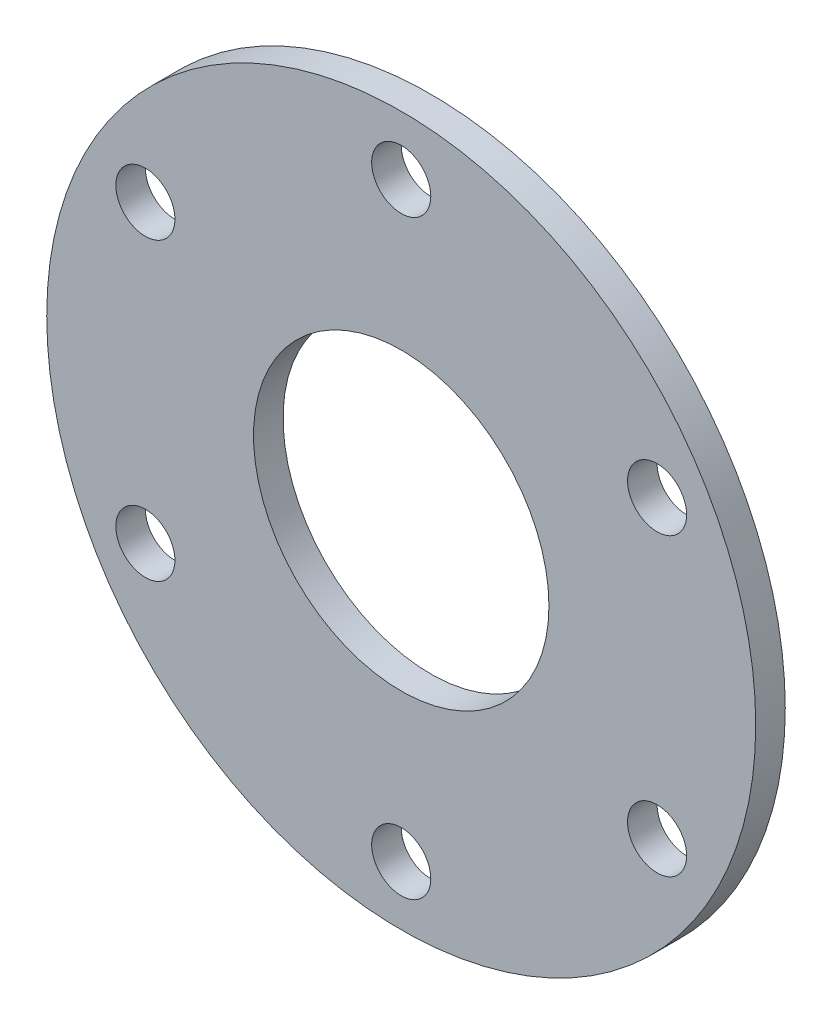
from build123d import *

# Parameters (mm, degrees)
SKETCH1_R           = 60
SKETCH1_R_2         = 5
BOSS_EXTRUDE1_DEPTH = 5
SKETCH2_R           = 25
CUT_EXTRUDE1_DEPTH  = 10


with BuildPart() as part:
    # Sketch1 → Boss-Extrude1 (new body)
    with BuildSketch(Plane.XY):
        Circle(SKETCH1_R)
        with Locations((0, 50)):
            Circle(SKETCH1_R_2, mode=Mode.SUBTRACT)
        with Locations((43.301270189, 25)):
            Circle(SKETCH1_R_2, mode=Mode.SUBTRACT)
        with Locations((43.301270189, -25)):
            Circle(SKETCH1_R_2, mode=Mode.SUBTRACT)
        with Locations((0, -50)):
            Circle(SKETCH1_R_2, mode=Mode.SUBTRACT)
        with Locations((-43.301270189, -25)):
            Circle(SKETCH1_R_2, mode=Mode.SUBTRACT)
        with Locations((-43.301270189, 25)):
            Circle(SKETCH1_R_2, mode=Mode.SUBTRACT)
    extrude(amount=BOSS_EXTRUDE1_DEPTH)

    # Sketch2 → Cut-Extrude1 (cut)
    with BuildSketch(Plane.XY.offset(5)):
        Circle(SKETCH2_R)
    extrude(amount=-CUT_EXTRUDE1_DEPTH, mode=Mode.SUBTRACT)


solid = part.part
